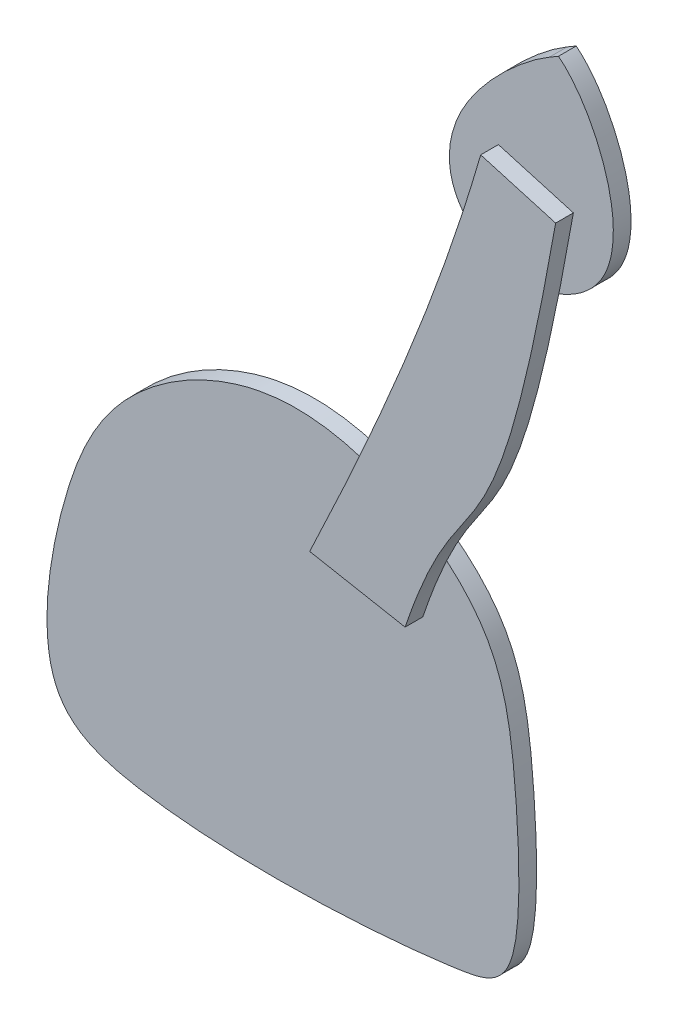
ISO-10303-21;
HEADER;
FILE_DESCRIPTION(('STEP AP214'),'2;1');
FILE_NAME('part.step','',(''),(''),'','','');
FILE_SCHEMA(('AUTOMOTIVE_DESIGN { 1 0 10303 214 1 1 1 1 }'));
ENDSEC;
DATA;
#1=APPLICATION_CONTEXT('core data for automotive mechanical design processes');
#2=APPLICATION_PROTOCOL_DEFINITION('international standard','automotive_design',2000,#1);
#3=PRODUCT_CONTEXT('',#1,'mechanical');
#4=PRODUCT('Part','Part','',(#3));
#5=PRODUCT_RELATED_PRODUCT_CATEGORY('part','',(#4));
#6=PRODUCT_DEFINITION_FORMATION('','',#4);
#7=PRODUCT_DEFINITION_CONTEXT('part definition',#1,'design');
#8=PRODUCT_DEFINITION('design','',#6,#7);
#9=PRODUCT_DEFINITION_SHAPE('','',#8);
#10=(LENGTH_UNIT() NAMED_UNIT(*) SI_UNIT(.MILLI.,.METRE.));
#11=(NAMED_UNIT(*) PLANE_ANGLE_UNIT() SI_UNIT($,.RADIAN.));
#12=(NAMED_UNIT(*) SI_UNIT($,.STERADIAN.) SOLID_ANGLE_UNIT());
#13=UNCERTAINTY_MEASURE_WITH_UNIT(LENGTH_MEASURE(1.E-05),#10,'distance_accuracy_value','');
#14=(GEOMETRIC_REPRESENTATION_CONTEXT(3) GLOBAL_UNCERTAINTY_ASSIGNED_CONTEXT((#13)) GLOBAL_UNIT_ASSIGNED_CONTEXT((#10,
#11,#12)) REPRESENTATION_CONTEXT('',''));
#15=CARTESIAN_POINT('',(0.,0.,0.));
#16=DIRECTION('',(0.,0.,1.));
#17=DIRECTION('',(1.,0.,0.));
#18=AXIS2_PLACEMENT_3D('',#15,#16,#17);
#19=CARTESIAN_POINT('',(44.2384418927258,102.786836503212,6.35));
#20=DIRECTION('',(-0.276991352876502,-0.960872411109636,0.));
#21=DIRECTION('',(0.960872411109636,-0.276991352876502,0.));
#22=AXIS2_PLACEMENT_3D('',#19,#20,#21);
#23=PLANE('',#22);
#24=DIRECTION('',(-0.960872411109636,0.276991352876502,0.));
#25=VECTOR('',#24,1.);
#26=CARTESIAN_POINT('',(44.2384418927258,102.786836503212,3.175));
#27=LINE('',#26,#25);
#28=CARTESIAN_POINT('',(51.845510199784,100.593941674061,3.175));
#29=VERTEX_POINT('',#28);
#30=CARTESIAN_POINT('',(38.4211702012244,104.463785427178,3.175));
#31=VERTEX_POINT('',#30);
#32=EDGE_CURVE('E121',#29,#31,#27,.T.);
#33=ORIENTED_EDGE('',*,*,#32,.T.);
#34=DIRECTION('',(0.,0.,-1.));
#35=VECTOR('',#34,1.);
#36=CARTESIAN_POINT('',(38.4211702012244,104.463785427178,6.35));
#37=LINE('',#36,#35);
#38=CARTESIAN_POINT('',(38.4211702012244,104.463785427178,6.35));
#39=VERTEX_POINT('',#38);
#40=EDGE_CURVE('E12',#39,#31,#37,.T.);
#41=ORIENTED_EDGE('',*,*,#40,.F.);
#42=DIRECTION('',(-0.960872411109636,0.276991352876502,0.));
#43=VECTOR('',#42,1.);
#44=CARTESIAN_POINT('',(44.2384418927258,102.786836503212,6.35));
#45=LINE('',#44,#43);
#46=CARTESIAN_POINT('',(51.845510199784,100.593941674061,6.35));
#47=VERTEX_POINT('',#46);
#48=EDGE_CURVE('E92',#47,#39,#45,.T.);
#49=ORIENTED_EDGE('',*,*,#48,.F.);
#50=DIRECTION('',(0.,0.,-1.));
#51=VECTOR('',#50,1.);
#52=CARTESIAN_POINT('',(51.845510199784,100.593941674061,6.35));
#53=LINE('',#52,#51);
#54=EDGE_CURVE('E68',#47,#29,#53,.T.);
#55=ORIENTED_EDGE('',*,*,#54,.T.);
#56=EDGE_LOOP('',(#33,#41,#49,#55));
#57=FACE_BOUND('',#56,.T.);
#58=ADVANCED_FACE('F52',(#57),#23,.F.);
#59=CARTESIAN_POINT('',(7.80247849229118,27.6429497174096,6.35));
#60=CARTESIAN_POINT('',(22.5887766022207,58.5425015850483,6.35));
#61=CARTESIAN_POINT('',(31.9122750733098,81.8846771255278,6.35));
#62=CARTESIAN_POINT('',(38.4211702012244,104.463785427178,6.35));
#63=B_SPLINE_CURVE_WITH_KNOTS('',3,(#59,#60,#61,#62),.UNSPECIFIED.,.F.,.F.,(4,4),(0.,1.),.UNSPECIFIED.);
#64=DIRECTION('',(0.,0.,-1.));
#65=VECTOR('',#64,1.);
#66=SURFACE_OF_LINEAR_EXTRUSION('',#63,#65);
#67=CARTESIAN_POINT('',(7.80247849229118,27.6429497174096,3.175));
#68=CARTESIAN_POINT('',(22.5887766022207,58.5425015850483,3.175));
#69=CARTESIAN_POINT('',(31.9122750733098,81.8846771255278,3.175));
#70=CARTESIAN_POINT('',(38.4211702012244,104.463785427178,3.175));
#71=B_SPLINE_CURVE_WITH_KNOTS('',3,(#67,#68,#69,#70),.UNSPECIFIED.,.F.,.F.,(4,4),(0.,1.),.UNSPECIFIED.);
#72=CARTESIAN_POINT('',(7.80247849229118,27.6429497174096,3.175));
#73=VERTEX_POINT('',#72);
#74=EDGE_CURVE('E101',#73,#31,#71,.T.);
#75=ORIENTED_EDGE('',*,*,#74,.F.);
#76=DIRECTION('',(0.,0.,-1.));
#77=VECTOR('',#76,1.);
#78=CARTESIAN_POINT('',(7.80247849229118,27.6429497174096,6.35));
#79=LINE('',#78,#77);
#80=CARTESIAN_POINT('',(7.80247849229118,27.6429497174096,6.35));
#81=VERTEX_POINT('',#80);
#82=EDGE_CURVE('E60',#81,#73,#79,.T.);
#83=ORIENTED_EDGE('',*,*,#82,.F.);
#84=EDGE_CURVE('E99',#81,#39,#63,.T.);
#85=ORIENTED_EDGE('',*,*,#84,.T.);
#86=ORIENTED_EDGE('',*,*,#40,.T.);
#87=EDGE_LOOP('',(#75,#83,#85,#86));
#88=FACE_BOUND('',#87,.T.);
#89=ADVANCED_FACE('F98',(#88),#66,.T.);
#90=CARTESIAN_POINT('',(16.5282656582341,26.0103555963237,6.35));
#91=DIRECTION('',(-0.183908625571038,-0.982943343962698,0.));
#92=DIRECTION('',(0.982943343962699,-0.183908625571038,0.));
#93=AXIS2_PLACEMENT_3D('',#90,#91,#92);
#94=PLANE('',#93);
#95=DIRECTION('',(-0.982943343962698,0.183908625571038,0.));
#96=VECTOR('',#95,1.);
#97=CARTESIAN_POINT('',(16.5282656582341,26.0103555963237,3.175));
#98=LINE('',#97,#96);
#99=CARTESIAN_POINT('',(24.8832179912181,24.4471446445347,3.175));
#100=VERTEX_POINT('',#99);
#101=EDGE_CURVE('E142',#100,#73,#98,.T.);
#102=ORIENTED_EDGE('',*,*,#101,.F.);
#103=DIRECTION('',(0.,0.,-1.));
#104=VECTOR('',#103,1.);
#105=CARTESIAN_POINT('',(24.8832179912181,24.4471446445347,6.35));
#106=LINE('',#105,#104);
#107=CARTESIAN_POINT('',(24.8832179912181,24.4471446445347,6.35));
#108=VERTEX_POINT('',#107);
#109=EDGE_CURVE('E81',#108,#100,#106,.T.);
#110=ORIENTED_EDGE('',*,*,#109,.F.);
#111=DIRECTION('',(-0.982943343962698,0.183908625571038,0.));
#112=VECTOR('',#111,1.);
#113=CARTESIAN_POINT('',(16.5282656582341,26.0103555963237,6.35));
#114=LINE('',#113,#112);
#115=EDGE_CURVE('E107',#108,#81,#114,.T.);
#116=ORIENTED_EDGE('',*,*,#115,.T.);
#117=ORIENTED_EDGE('',*,*,#82,.T.);
#118=EDGE_LOOP('',(#102,#110,#116,#117));
#119=FACE_BOUND('',#118,.T.);
#120=ADVANCED_FACE('F109',(#119),#94,.T.);
#121=CARTESIAN_POINT('',(51.845510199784,100.593941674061,6.35));
#122=CARTESIAN_POINT('',(40.2749373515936,35.195244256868,6.35));
#123=CARTESIAN_POINT('',(35.906328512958,57.0659527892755,6.35));
#124=CARTESIAN_POINT('',(24.8832179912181,24.4471446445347,6.35));
#125=B_SPLINE_CURVE_WITH_KNOTS('',3,(#121,#122,#123,#124),.UNSPECIFIED.,.F.,.F.,(4,4),(0.,1.),.UNSPECIFIED.);
#126=DIRECTION('',(0.,0.,-1.));
#127=VECTOR('',#126,1.);
#128=SURFACE_OF_LINEAR_EXTRUSION('',#125,#127);
#129=CARTESIAN_POINT('',(51.845510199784,100.593941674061,3.175));
#130=CARTESIAN_POINT('',(40.2749373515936,35.195244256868,3.175));
#131=CARTESIAN_POINT('',(35.906328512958,57.0659527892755,3.175));
#132=CARTESIAN_POINT('',(24.8832179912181,24.4471446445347,3.175));
#133=B_SPLINE_CURVE_WITH_KNOTS('',3,(#129,#130,#131,#132),.UNSPECIFIED.,.F.,.F.,(4,4),(0.,1.),.UNSPECIFIED.);
#134=EDGE_CURVE('E143',#29,#100,#133,.T.);
#135=ORIENTED_EDGE('',*,*,#134,.F.);
#136=ORIENTED_EDGE('',*,*,#54,.F.);
#137=EDGE_CURVE('E110',#47,#108,#125,.T.);
#138=ORIENTED_EDGE('',*,*,#137,.T.);
#139=ORIENTED_EDGE('',*,*,#109,.T.);
#140=EDGE_LOOP('',(#135,#136,#138,#139));
#141=FACE_BOUND('',#140,.T.);
#142=ADVANCED_FACE('F127',(#141),#128,.T.);
#143=CARTESIAN_POINT('',(26.2158504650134,69.1735339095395,6.35));
#144=DIRECTION('',(0.,0.,-1.));
#145=DIRECTION('',(-1.,0.,0.));
#146=AXIS2_PLACEMENT_3D('',#143,#144,#145);
#147=PLANE('',#146);
#148=ORIENTED_EDGE('',*,*,#48,.T.);
#149=ORIENTED_EDGE('',*,*,#84,.F.);
#150=ORIENTED_EDGE('',*,*,#115,.F.);
#151=ORIENTED_EDGE('',*,*,#137,.F.);
#152=EDGE_LOOP('',(#148,#149,#150,#151));
#153=FACE_BOUND('',#152,.T.);
#154=ADVANCED_FACE('F106',(#153),#147,.F.);
#155=CARTESIAN_POINT('',(26.2158504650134,69.1735339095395,3.175));
#156=DIRECTION('',(0.,0.,-1.));
#157=DIRECTION('',(-1.,0.,0.));
#158=AXIS2_PLACEMENT_3D('',#155,#156,#157);
#159=PLANE('',#158);
#160=ORIENTED_EDGE('',*,*,#32,.F.);
#161=ORIENTED_EDGE('',*,*,#134,.T.);
#162=ORIENTED_EDGE('',*,*,#101,.T.);
#163=ORIENTED_EDGE('',*,*,#74,.T.);
#164=EDGE_LOOP('',(#160,#161,#162,#163));
#165=FACE_BOUND('',#164,.T.);
#166=ADVANCED_FACE('F131',(#165),#159,.T.);
#167=CLOSED_SHELL('',(#58,#89,#120,#142,#154,#166));
#168=MANIFOLD_SOLID_BREP('B2',#167);
#169=CARTESIAN_POINT('',(47.5469722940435,122.592217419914,3.175));
#170=CARTESIAN_POINT('',(42.8982482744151,119.869200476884,3.175));
#171=CARTESIAN_POINT('',(29.7072656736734,108.380537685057,3.175));
#172=CARTESIAN_POINT('',(28.7216659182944,94.2825096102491,3.175));
#173=CARTESIAN_POINT('',(35.9563865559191,86.5938374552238,3.175));
#174=CARTESIAN_POINT('',(46.1514182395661,84.2797243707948,3.175));
#175=CARTESIAN_POINT('',(65.5509617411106,95.1730288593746,3.175));
#176=CARTESIAN_POINT('',(55.841116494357,118.322283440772,3.175));
#177=CARTESIAN_POINT('',(49.1799999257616,123.548772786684,3.175));
#178=B_SPLINE_CURVE_WITH_KNOTS('',3,(#169,#170,#171,#172,#173,#174,#175,#176,#177),
.UNSPECIFIED.,.F.,.F.,(4,1,1,1,1,1,4),(0.,0.205286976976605,0.353401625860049,0.407522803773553,
0.517432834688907,0.647818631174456,1.),.UNSPECIFIED.);
#179=DIRECTION('',(0.,0.,-1.));
#180=VECTOR('',#179,1.);
#181=SURFACE_OF_LINEAR_EXTRUSION('',#178,#180);
#182=CARTESIAN_POINT('',(47.5469722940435,122.592217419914,0.));
#183=CARTESIAN_POINT('',(42.8982482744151,119.869200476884,0.));
#184=CARTESIAN_POINT('',(29.7072656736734,108.380537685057,0.));
#185=CARTESIAN_POINT('',(28.7216659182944,94.2825096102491,0.));
#186=CARTESIAN_POINT('',(35.9563865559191,86.5938374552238,0.));
#187=CARTESIAN_POINT('',(46.1514182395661,84.2797243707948,0.));
#188=CARTESIAN_POINT('',(65.5509617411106,95.1730288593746,0.));
#189=CARTESIAN_POINT('',(55.841116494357,118.322283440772,0.));
#190=CARTESIAN_POINT('',(49.1799999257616,123.548772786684,0.));
#191=B_SPLINE_CURVE_WITH_KNOTS('',3,(#182,#183,#184,#185,#186,#187,#188,#189,#190),
.UNSPECIFIED.,.F.,.F.,(4,1,1,1,1,1,4),(0.,0.205286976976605,0.353401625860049,0.407522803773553,
0.517432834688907,0.647818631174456,1.),.UNSPECIFIED.);
#192=CARTESIAN_POINT('',(47.5469722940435,122.592217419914,0.));
#193=VERTEX_POINT('',#192);
#194=CARTESIAN_POINT('',(49.1799999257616,123.548772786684,0.));
#195=VERTEX_POINT('',#194);
#196=EDGE_CURVE('E50',#193,#195,#191,.T.);
#197=ORIENTED_EDGE('',*,*,#196,.T.);
#198=DIRECTION('',(0.,0.,-1.));
#199=VECTOR('',#198,1.);
#200=CARTESIAN_POINT('',(49.1799999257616,123.548772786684,3.175));
#201=LINE('',#200,#199);
#202=CARTESIAN_POINT('',(49.1799999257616,123.548772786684,3.175));
#203=VERTEX_POINT('',#202);
#204=EDGE_CURVE('E228',#203,#195,#201,.T.);
#205=ORIENTED_EDGE('',*,*,#204,.F.);
#206=CARTESIAN_POINT('',(47.5469722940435,122.592217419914,3.175));
#207=VERTEX_POINT('',#206);
#208=EDGE_CURVE('E210',#207,#203,#178,.T.);
#209=ORIENTED_EDGE('',*,*,#208,.F.);
#210=DIRECTION('',(0.,0.,-1.));
#211=VECTOR('',#210,1.);
#212=CARTESIAN_POINT('',(47.5469722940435,122.592217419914,3.175));
#213=LINE('',#212,#211);
#214=EDGE_CURVE('E233',#207,#193,#213,.T.);
#215=ORIENTED_EDGE('',*,*,#214,.T.);
#216=EDGE_LOOP('',(#197,#205,#209,#215));
#217=FACE_BOUND('',#216,.T.);
#218=ADVANCED_FACE('F206',(#217),#181,.F.);
#219=CARTESIAN_POINT('',(47.5469722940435,122.592217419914,3.175));
#220=DIRECTION('',(-0.505429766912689,0.862867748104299,0.));
#221=DIRECTION('',(-0.8628677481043,-0.505429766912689,0.));
#222=AXIS2_PLACEMENT_3D('',#219,#220,#221);
#223=PLANE('',#222);
#224=DIRECTION('',(0.862867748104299,0.505429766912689,0.));
#225=VECTOR('',#224,1.);
#226=CARTESIAN_POINT('',(47.5469722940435,122.592217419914,0.));
#227=LINE('',#226,#225);
#228=EDGE_CURVE('E219',#193,#195,#227,.T.);
#229=ORIENTED_EDGE('',*,*,#228,.F.);
#230=ORIENTED_EDGE('',*,*,#214,.F.);
#231=DIRECTION('',(0.862867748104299,0.505429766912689,0.));
#232=VECTOR('',#231,1.);
#233=CARTESIAN_POINT('',(47.5469722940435,122.592217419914,3.175));
#234=LINE('',#233,#232);
#235=EDGE_CURVE('E238',#207,#203,#234,.T.);
#236=ORIENTED_EDGE('',*,*,#235,.T.);
#237=ORIENTED_EDGE('',*,*,#204,.T.);
#238=EDGE_LOOP('',(#229,#230,#236,#237));
#239=FACE_BOUND('',#238,.T.);
#240=ADVANCED_FACE('F243',(#239),#223,.T.);
#241=CARTESIAN_POINT('',(43.5783271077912,85.6425873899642,3.175));
#242=DIRECTION('',(0.,0.,-1.));
#243=DIRECTION('',(-1.,0.,0.));
#244=AXIS2_PLACEMENT_3D('',#241,#242,#243);
#245=PLANE('',#244);
#246=ORIENTED_EDGE('',*,*,#208,.T.);
#247=ORIENTED_EDGE('',*,*,#235,.F.);
#248=EDGE_LOOP('',(#246,#247));
#249=FACE_BOUND('',#248,.T.);
#250=ADVANCED_FACE('F208',(#249),#245,.F.);
#251=CARTESIAN_POINT('',(43.5783271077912,85.6425873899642,0.));
#252=DIRECTION('',(0.,0.,-1.));
#253=DIRECTION('',(-1.,0.,0.));
#254=AXIS2_PLACEMENT_3D('',#251,#252,#253);
#255=PLANE('',#254);
#256=ORIENTED_EDGE('',*,*,#196,.F.);
#257=ORIENTED_EDGE('',*,*,#228,.T.);
#258=EDGE_LOOP('',(#256,#257));
#259=FACE_BOUND('',#258,.T.);
#260=ADVANCED_FACE('F252',(#259),#255,.T.);
#261=CLOSED_SHELL('',(#218,#240,#250,#260));
#262=MANIFOLD_SOLID_BREP('B6',#261);
#263=CARTESIAN_POINT('',(-4.51156140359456,44.8161066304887,3.175));
#264=CARTESIAN_POINT('',(-0.4571421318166,45.5948376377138,3.175));
#265=CARTESIAN_POINT('',(14.3527064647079,45.9265010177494,3.175));
#266=CARTESIAN_POINT('',(37.9105084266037,32.1981571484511,3.175));
#267=CARTESIAN_POINT('',(41.7727031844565,8.42152067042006,3.175));
#268=CARTESIAN_POINT('',(42.9796390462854,-24.7692155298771,3.175));
#269=CARTESIAN_POINT('',(25.4790690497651,-28.6314102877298,3.175));
#270=CARTESIAN_POINT('',(-17.9706219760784,-31.0452820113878,3.175));
#271=CARTESIAN_POINT('',(-45.3680660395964,-22.476037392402,3.175));
#272=CARTESIAN_POINT('',(-40.754173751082,9.9954552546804,3.175));
#273=CARTESIAN_POINT('',(-30.5227549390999,33.0430122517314,3.175));
#274=CARTESIAN_POINT('',(-14.1376862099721,42.9672199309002,3.175));
#275=CARTESIAN_POINT('',(-4.51156140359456,44.8161066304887,3.175));
#276=B_SPLINE_CURVE_WITH_KNOTS('',3,(#263,#264,#265,#266,#267,#268,#269,#270,#271,#272,#273,
#274,#275),.UNSPECIFIED.,.T.,.F.,(4,1,1,1,1,1,1,1,1,1,4),(0.,0.0478372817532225,
0.173390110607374,0.25589527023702,0.333306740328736,0.401840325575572,0.61175164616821,
0.695454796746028,0.803039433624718,0.886423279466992,1.),.UNSPECIFIED.);
#277=DIRECTION('',(0.,0.,-1.));
#278=VECTOR('',#277,1.);
#279=SURFACE_OF_LINEAR_EXTRUSION('',#276,#278);
#280=CARTESIAN_POINT('',(-4.51156140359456,44.8161066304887,3.175));
#281=VERTEX_POINT('',#280);
#282=EDGE_CURVE('E205',#281,#281,#276,.T.);
#283=ORIENTED_EDGE('',*,*,#282,.T.);
#284=EDGE_LOOP('',(#283));
#285=FACE_BOUND('',#284,.T.);
#286=CARTESIAN_POINT('',(-4.51156140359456,44.8161066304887,0.));
#287=CARTESIAN_POINT('',(-0.4571421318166,45.5948376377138,0.));
#288=CARTESIAN_POINT('',(14.3527064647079,45.9265010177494,0.));
#289=CARTESIAN_POINT('',(37.9105084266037,32.1981571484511,0.));
#290=CARTESIAN_POINT('',(41.7727031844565,8.42152067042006,0.));
#291=CARTESIAN_POINT('',(42.9796390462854,-24.7692155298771,0.));
#292=CARTESIAN_POINT('',(25.4790690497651,-28.6314102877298,0.));
#293=CARTESIAN_POINT('',(-17.9706219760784,-31.0452820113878,0.));
#294=CARTESIAN_POINT('',(-45.3680660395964,-22.476037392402,0.));
#295=CARTESIAN_POINT('',(-40.754173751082,9.9954552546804,0.));
#296=CARTESIAN_POINT('',(-30.5227549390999,33.0430122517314,0.));
#297=CARTESIAN_POINT('',(-14.1376862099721,42.9672199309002,0.));
#298=CARTESIAN_POINT('',(-4.51156140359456,44.8161066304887,0.));
#299=B_SPLINE_CURVE_WITH_KNOTS('',3,(#286,#287,#288,#289,#290,#291,#292,#293,#294,#295,#296,
#297,#298),.UNSPECIFIED.,.T.,.F.,(4,1,1,1,1,1,1,1,1,1,4),(0.,0.0478372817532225,
0.173390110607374,0.25589527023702,0.333306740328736,0.401840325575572,0.61175164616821,
0.695454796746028,0.803039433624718,0.886423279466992,1.),.UNSPECIFIED.);
#300=CARTESIAN_POINT('',(-4.51156140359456,44.8161066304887,0.));
#301=VERTEX_POINT('',#300);
#302=EDGE_CURVE('E300',#301,#301,#299,.T.);
#303=ORIENTED_EDGE('',*,*,#302,.F.);
#304=EDGE_LOOP('',(#303));
#305=FACE_BOUND('',#304,.T.);
#306=ADVANCED_FACE('F296',(#285,#305),#279,.T.);
#307=CARTESIAN_POINT('',(6.21303473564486,-29.1218468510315,3.175));
#308=DIRECTION('',(0.,0.,1.));
#309=DIRECTION('',(1.,0.,0.));
#310=AXIS2_PLACEMENT_3D('',#307,#308,#309);
#311=PLANE('',#310);
#312=ORIENTED_EDGE('',*,*,#282,.F.);
#313=EDGE_LOOP('',(#312));
#314=FACE_BOUND('',#313,.T.);
#315=ADVANCED_FACE('F321',(#314),#311,.T.);
#316=CARTESIAN_POINT('',(6.21303473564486,-29.1218468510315,0.));
#317=DIRECTION('',(0.,0.,1.));
#318=DIRECTION('',(1.,0.,0.));
#319=AXIS2_PLACEMENT_3D('',#316,#317,#318);
#320=PLANE('',#319);
#321=ORIENTED_EDGE('',*,*,#302,.T.);
#322=EDGE_LOOP('',(#321));
#323=FACE_BOUND('',#322,.T.);
#324=ADVANCED_FACE('F318',(#323),#320,.F.);
#325=CLOSED_SHELL('',(#306,#315,#324));
#326=MANIFOLD_SOLID_BREP('B44',#325);
#327=CARTESIAN_POINT('',(0.,0.,-3.175));
#328=DIRECTION('',(0.,0.,1.));
#329=DIRECTION('',(1.,0.,0.));
#330=AXIS2_PLACEMENT_3D('',#327,#328,#329);
#331=CYLINDRICAL_SURFACE('',#330,25.4);
#332=CARTESIAN_POINT('',(0.,0.,-3.175));
#333=DIRECTION('',(0.,0.,1.));
#334=DIRECTION('',(1.,0.,0.));
#335=AXIS2_PLACEMENT_3D('',#332,#333,#334);
#336=CIRCLE('',#335,25.4);
#337=CARTESIAN_POINT('',(25.4,0.,-3.175));
#338=VERTEX_POINT('',#337);
#339=EDGE_CURVE('E295',#338,#338,#336,.T.);
#340=ORIENTED_EDGE('',*,*,#339,.T.);
#341=EDGE_LOOP('',(#340));
#342=FACE_BOUND('',#341,.T.);
#343=CARTESIAN_POINT('',(0.,0.,0.));
#344=DIRECTION('',(0.,0.,1.));
#345=DIRECTION('',(1.,0.,0.));
#346=AXIS2_PLACEMENT_3D('',#343,#344,#345);
#347=CIRCLE('',#346,25.4);
#348=CARTESIAN_POINT('',(25.4,0.,0.));
#349=VERTEX_POINT('',#348);
#350=EDGE_CURVE('E353',#349,#349,#347,.T.);
#351=ORIENTED_EDGE('',*,*,#350,.F.);
#352=EDGE_LOOP('',(#351));
#353=FACE_BOUND('',#352,.T.);
#354=ADVANCED_FACE('F350',(#342,#353),#331,.T.);
#355=CARTESIAN_POINT('',(0.,0.,-3.175));
#356=DIRECTION('',(0.,0.,1.));
#357=DIRECTION('',(1.,0.,0.));
#358=AXIS2_PLACEMENT_3D('',#355,#356,#357);
#359=PLANE('',#358);
#360=ORIENTED_EDGE('',*,*,#339,.F.);
#361=EDGE_LOOP('',(#360));
#362=FACE_BOUND('',#361,.T.);
#363=ADVANCED_FACE('F365',(#362),#359,.F.);
#364=CARTESIAN_POINT('',(0.,0.,0.));
#365=DIRECTION('',(0.,0.,1.));
#366=DIRECTION('',(1.,0.,0.));
#367=AXIS2_PLACEMENT_3D('',#364,#365,#366);
#368=PLANE('',#367);
#369=ORIENTED_EDGE('',*,*,#350,.T.);
#370=EDGE_LOOP('',(#369));
#371=FACE_BOUND('',#370,.T.);
#372=ADVANCED_FACE('F362',(#371),#368,.T.);
#373=CLOSED_SHELL('',(#354,#363,#372));
#374=MANIFOLD_SOLID_BREP('B200',#373);
#375=ADVANCED_BREP_SHAPE_REPRESENTATION('',(#18,#168,#262,#326,#374),#14);
#376=SHAPE_DEFINITION_REPRESENTATION(#9,#375);
ENDSEC;
END-ISO-10303-21;
